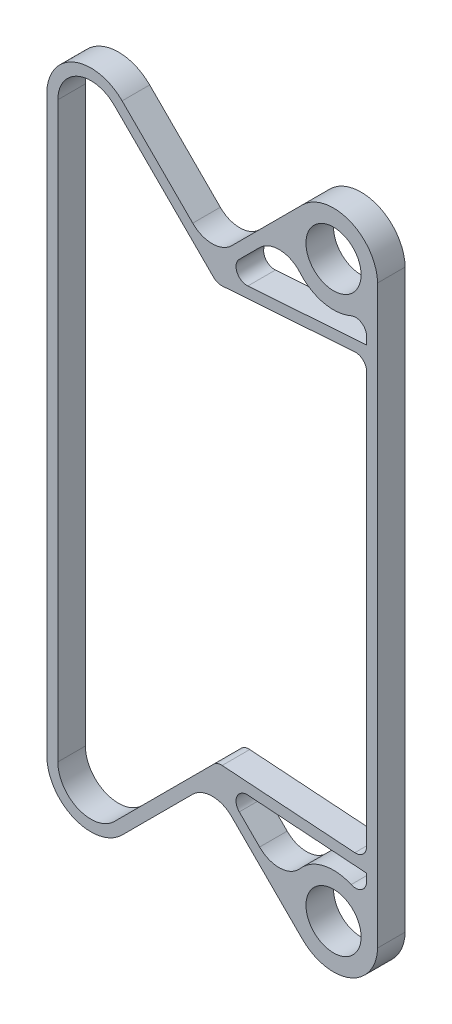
from build123d import *

# Parameters (mm, degrees)
ESQUISSE1_R        = 50
BOSS_EXTRU_1_DEPTH = 50


with BuildPart() as part:
    # Esquisse1 → Boss.-Extru.1 (new body)
    with BuildSketch(Plane.XY):
        with BuildLine():
            Line((279.967205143, 0), (299.967205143, 0))
            Line((299.967205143, 0), (299.967205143, 517.709563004))
            Line((299.967205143, 517.709563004), (299.967205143, 522.290436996))
            ThreePointArc((299.967205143, 522.290436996), (275.752870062, 577.372619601), (220, 600))
            ThreePointArc((220, 600), (189.385325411, 593.910362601), (163.431457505, 576.568542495))
            Line((163.431457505, 576.568542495), (35.355339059, 448.492424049))
            ThreePointArc((35.355339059, 448.492424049), (0, 433.847763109), (-35.355339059, 448.492424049))
            Line((-35.355339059, 448.492424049), (-163.431457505, 576.568542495))
            ThreePointArc((-163.431457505, 576.568542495), (-189.385325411, 593.910362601), (-220, 600))
            ThreePointArc((-220, 600), (-276.568542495, 576.568542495), (-300, 520))
            Line((-300, 520), (-300, 0))
            Line((-300, 0), (-280, 0))
            Line((-280, 0), (-280, 520))
            ThreePointArc((-280, 520), (-242.961005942, 575.432771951), (-177.573593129, 562.426406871))
            Line((-177.573593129, 562.426406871), (2.501016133, 382.35179761))
            ThreePointArc((2.501016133, 382.35179761), (9.635538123, 377.761785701), (18.030898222, 376.542137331))
            Line((18.030898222, 376.542137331), (258.579458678, 393.273484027))
            ThreePointArc((258.579458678, 393.273484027), (273.609878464, 387.946238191), (279.967205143, 373.321688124))
            Line((279.967205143, 373.321688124), (279.967205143, 0))
        make_face()
        with BuildLine():
            ThreePointArc((64.600612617, 399.829612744), (45.012106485, 411.490911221), (49.070730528, 433.92354427))
            Line((49.070730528, 433.92354427), (85.92207923, 470.774892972))
            ThreePointArc((85.92207923, 470.774892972), (123.201921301, 485.382503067), (159.247642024, 467.950494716))
            ThreePointArc((159.247642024, 467.950494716), (189.106310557, 446.205827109), (225.550985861, 440.192816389))
            ThreePointArc((225.550985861, 440.192816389), (239.039605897, 442.298691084), (251.973764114, 446.667344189))
            ThreePointArc((251.973764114, 446.667344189), (270.924649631, 445.065420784), (279.967205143, 428.334180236))
            Line((279.967205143, 428.334180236), (279.967205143, 414.809428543))
            Line((279.967205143, 414.809428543), (64.600612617, 399.829612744))
        make_face(mode=Mode.SUBTRACT)
        with Locations((220, 520)):
            Circle(ESQUISSE1_R, mode=Mode.SUBTRACT)
    extrude(amount=BOSS_EXTRU_1_DEPTH)

    # Sym_trie1: part across plane


with BuildPart() as part_1:
    add(part.part)
    add(part.part.mirror(Plane.ZX))


solid = part_1.part
